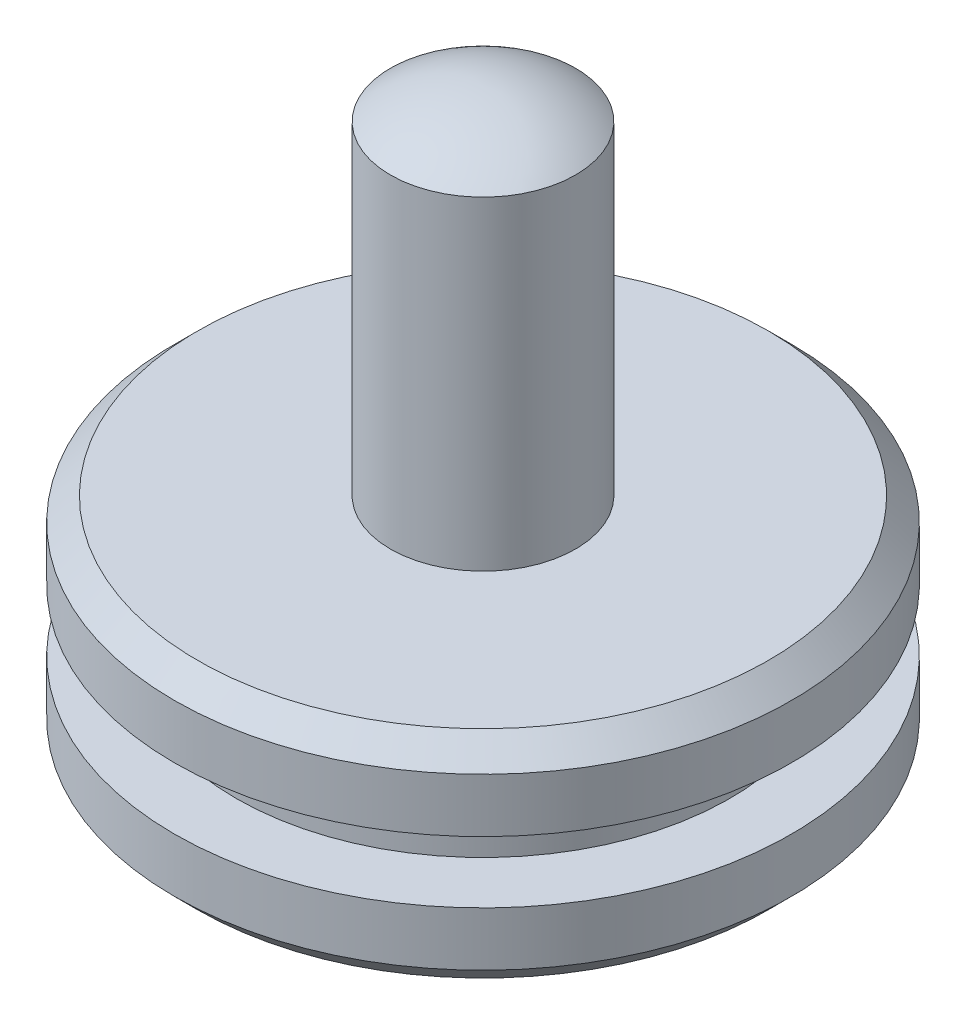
ISO-10303-21;
HEADER;
FILE_DESCRIPTION(('STEP AP214'),'2;1');
FILE_NAME('part.step','',(''),(''),'','','');
FILE_SCHEMA(('AUTOMOTIVE_DESIGN { 1 0 10303 214 1 1 1 1 }'));
ENDSEC;
DATA;
#1=APPLICATION_CONTEXT('core data for automotive mechanical design processes');
#2=APPLICATION_PROTOCOL_DEFINITION('international standard','automotive_design',2000,#1);
#3=PRODUCT_CONTEXT('',#1,'mechanical');
#4=PRODUCT('Part','Part','',(#3));
#5=PRODUCT_RELATED_PRODUCT_CATEGORY('part','',(#4));
#6=PRODUCT_DEFINITION_FORMATION('','',#4);
#7=PRODUCT_DEFINITION_CONTEXT('part definition',#1,'design');
#8=PRODUCT_DEFINITION('design','',#6,#7);
#9=PRODUCT_DEFINITION_SHAPE('','',#8);
#10=(LENGTH_UNIT() NAMED_UNIT(*) SI_UNIT(.MILLI.,.METRE.));
#11=(NAMED_UNIT(*) PLANE_ANGLE_UNIT() SI_UNIT($,.RADIAN.));
#12=(NAMED_UNIT(*) SI_UNIT($,.STERADIAN.) SOLID_ANGLE_UNIT());
#13=UNCERTAINTY_MEASURE_WITH_UNIT(LENGTH_MEASURE(1.E-05),#10,'distance_accuracy_value','');
#14=(GEOMETRIC_REPRESENTATION_CONTEXT(3) GLOBAL_UNCERTAINTY_ASSIGNED_CONTEXT((#13)) GLOBAL_UNIT_ASSIGNED_CONTEXT((#10,
#11,#12)) REPRESENTATION_CONTEXT('',''));
#15=CARTESIAN_POINT('',(0.,0.,0.));
#16=DIRECTION('',(0.,0.,1.));
#17=DIRECTION('',(1.,0.,0.));
#18=AXIS2_PLACEMENT_3D('',#15,#16,#17);
#19=CARTESIAN_POINT('',(0.,27.,0.));
#20=DIRECTION('',(0.,1.,0.));
#21=DIRECTION('',(1.,0.,0.));
#22=AXIS2_PLACEMENT_3D('',#19,#20,#21);
#23=SPHERICAL_SURFACE('',#22,10.);
#24=CARTESIAN_POINT('',(0.,35.,0.));
#25=DIRECTION('',(0.,1.,0.));
#26=DIRECTION('',(0.,0.,1.));
#27=AXIS2_PLACEMENT_3D('',#24,#25,#26);
#28=CIRCLE('',#27,6.);
#29=CARTESIAN_POINT('',(0.,35.,6.));
#30=VERTEX_POINT('',#29);
#31=EDGE_CURVE('E63',#30,#30,#28,.T.);
#32=ORIENTED_EDGE('',*,*,#31,.T.);
#33=EDGE_LOOP('',(#32));
#34=FACE_BOUND('',#33,.T.);
#35=ADVANCED_FACE('F29',(#34),#23,.T.);
#36=CARTESIAN_POINT('',(20.,0.,0.));
#37=DIRECTION('',(0.,1.,0.));
#38=DIRECTION('',(0.,0.,1.));
#39=AXIS2_PLACEMENT_3D('',#36,#37,#38);
#40=PLANE('',#39);
#41=CARTESIAN_POINT('',(0.,0.,0.));
#42=DIRECTION('',(0.,1.,0.));
#43=DIRECTION('',(0.,0.,1.));
#44=AXIS2_PLACEMENT_3D('',#41,#42,#43);
#45=CIRCLE('',#44,18.5);
#46=CARTESIAN_POINT('',(0.,0.,18.5));
#47=VERTEX_POINT('',#46);
#48=EDGE_CURVE('E10',#47,#47,#45,.F.);
#49=ORIENTED_EDGE('',*,*,#48,.T.);
#50=EDGE_LOOP('',(#49));
#51=FACE_BOUND('',#50,.T.);
#52=ADVANCED_FACE('F87',(#51),#40,.F.);
#53=CARTESIAN_POINT('',(0.,41.,0.));
#54=DIRECTION('',(0.,1.,0.));
#55=DIRECTION('',(0.,0.,1.));
#56=AXIS2_PLACEMENT_3D('',#53,#54,#55);
#57=CYLINDRICAL_SURFACE('',#56,20.);
#58=CARTESIAN_POINT('',(0.,1.50000000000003,0.));
#59=DIRECTION('',(0.,1.,0.));
#60=DIRECTION('',(0.,0.,1.));
#61=AXIS2_PLACEMENT_3D('',#58,#59,#60);
#62=CIRCLE('',#61,20.);
#63=CARTESIAN_POINT('',(0.,1.50000000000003,20.));
#64=VERTEX_POINT('',#63);
#65=EDGE_CURVE('E35',#64,#64,#62,.T.);
#66=ORIENTED_EDGE('',*,*,#65,.T.);
#67=EDGE_LOOP('',(#66));
#68=FACE_BOUND('',#67,.T.);
#69=CARTESIAN_POINT('',(0.,5.,0.));
#70=DIRECTION('',(0.,1.,0.));
#71=DIRECTION('',(0.,0.,1.));
#72=AXIS2_PLACEMENT_3D('',#69,#70,#71);
#73=CIRCLE('',#72,20.);
#74=CARTESIAN_POINT('',(0.,5.,20.));
#75=VERTEX_POINT('',#74);
#76=EDGE_CURVE('E48',#75,#75,#73,.T.);
#77=ORIENTED_EDGE('',*,*,#76,.F.);
#78=EDGE_LOOP('',(#77));
#79=FACE_BOUND('',#78,.T.);
#80=ADVANCED_FACE('F91',(#68,#79),#57,.T.);
#81=CARTESIAN_POINT('',(16.,5.,0.));
#82=DIRECTION('',(0.,-1.,0.));
#83=DIRECTION('',(0.,0.,-1.));
#84=AXIS2_PLACEMENT_3D('',#81,#82,#83);
#85=PLANE('',#84);
#86=CARTESIAN_POINT('',(0.,5.,0.));
#87=DIRECTION('',(0.,1.,0.));
#88=DIRECTION('',(0.,0.,1.));
#89=AXIS2_PLACEMENT_3D('',#86,#87,#88);
#90=CIRCLE('',#89,16.);
#91=CARTESIAN_POINT('',(0.,5.,16.));
#92=VERTEX_POINT('',#91);
#93=EDGE_CURVE('E51',#92,#92,#90,.T.);
#94=ORIENTED_EDGE('',*,*,#93,.F.);
#95=EDGE_LOOP('',(#94));
#96=FACE_BOUND('',#95,.T.);
#97=ORIENTED_EDGE('',*,*,#76,.T.);
#98=EDGE_LOOP('',(#97));
#99=FACE_BOUND('',#98,.T.);
#100=ADVANCED_FACE('F95',(#96,#99),#85,.F.);
#101=CARTESIAN_POINT('',(0.,41.,0.));
#102=DIRECTION('',(0.,1.,0.));
#103=DIRECTION('',(0.,0.,1.));
#104=AXIS2_PLACEMENT_3D('',#101,#102,#103);
#105=CYLINDRICAL_SURFACE('',#104,16.);
#106=CARTESIAN_POINT('',(0.,9.,0.));
#107=DIRECTION('',(0.,1.,0.));
#108=DIRECTION('',(0.,0.,1.));
#109=AXIS2_PLACEMENT_3D('',#106,#107,#108);
#110=CIRCLE('',#109,16.);
#111=CARTESIAN_POINT('',(0.,9.,16.));
#112=VERTEX_POINT('',#111);
#113=EDGE_CURVE('E54',#112,#112,#110,.T.);
#114=ORIENTED_EDGE('',*,*,#113,.F.);
#115=EDGE_LOOP('',(#114));
#116=FACE_BOUND('',#115,.T.);
#117=ORIENTED_EDGE('',*,*,#93,.T.);
#118=EDGE_LOOP('',(#117));
#119=FACE_BOUND('',#118,.T.);
#120=ADVANCED_FACE('F100',(#116,#119),#105,.T.);
#121=CARTESIAN_POINT('',(20.,9.,0.));
#122=DIRECTION('',(0.,1.,0.));
#123=DIRECTION('',(0.,0.,1.));
#124=AXIS2_PLACEMENT_3D('',#121,#122,#123);
#125=PLANE('',#124);
#126=CARTESIAN_POINT('',(0.,9.,0.));
#127=DIRECTION('',(0.,1.,0.));
#128=DIRECTION('',(0.,0.,1.));
#129=AXIS2_PLACEMENT_3D('',#126,#127,#128);
#130=CIRCLE('',#129,20.);
#131=CARTESIAN_POINT('',(0.,9.,20.));
#132=VERTEX_POINT('',#131);
#133=EDGE_CURVE('E57',#132,#132,#130,.T.);
#134=ORIENTED_EDGE('',*,*,#133,.F.);
#135=EDGE_LOOP('',(#134));
#136=FACE_BOUND('',#135,.T.);
#137=ORIENTED_EDGE('',*,*,#113,.T.);
#138=EDGE_LOOP('',(#137));
#139=FACE_BOUND('',#138,.T.);
#140=ADVANCED_FACE('F83',(#136,#139),#125,.F.);
#141=CARTESIAN_POINT('',(0.,41.,0.));
#142=DIRECTION('',(0.,1.,0.));
#143=DIRECTION('',(0.,0.,1.));
#144=AXIS2_PLACEMENT_3D('',#141,#142,#143);
#145=CYLINDRICAL_SURFACE('',#144,20.);
#146=CARTESIAN_POINT('',(0.,12.5,0.));
#147=DIRECTION('',(0.,-1.,0.));
#148=DIRECTION('',(0.,0.,-1.));
#149=AXIS2_PLACEMENT_3D('',#146,#147,#148);
#150=CIRCLE('',#149,20.);
#151=CARTESIAN_POINT('',(0.,12.5,-20.));
#152=VERTEX_POINT('',#151);
#153=EDGE_CURVE('E39',#152,#152,#150,.T.);
#154=ORIENTED_EDGE('',*,*,#153,.T.);
#155=EDGE_LOOP('',(#154));
#156=FACE_BOUND('',#155,.T.);
#157=ORIENTED_EDGE('',*,*,#133,.T.);
#158=EDGE_LOOP('',(#157));
#159=FACE_BOUND('',#158,.T.);
#160=ADVANCED_FACE('F77',(#156,#159),#145,.T.);
#161=CARTESIAN_POINT('',(6.,14.,0.));
#162=DIRECTION('',(0.,-1.,0.));
#163=DIRECTION('',(0.,0.,-1.));
#164=AXIS2_PLACEMENT_3D('',#161,#162,#163);
#165=PLANE('',#164);
#166=CARTESIAN_POINT('',(0.,14.,0.));
#167=DIRECTION('',(0.,-1.,0.));
#168=DIRECTION('',(0.,0.,-1.));
#169=AXIS2_PLACEMENT_3D('',#166,#167,#168);
#170=CIRCLE('',#169,18.5);
#171=CARTESIAN_POINT('',(0.,14.,-18.5));
#172=VERTEX_POINT('',#171);
#173=EDGE_CURVE('E43',#172,#172,#170,.F.);
#174=ORIENTED_EDGE('',*,*,#173,.T.);
#175=EDGE_LOOP('',(#174));
#176=FACE_BOUND('',#175,.T.);
#177=CARTESIAN_POINT('',(0.,14.,0.));
#178=DIRECTION('',(0.,1.,0.));
#179=DIRECTION('',(0.,0.,1.));
#180=AXIS2_PLACEMENT_3D('',#177,#178,#179);
#181=CIRCLE('',#180,6.);
#182=CARTESIAN_POINT('',(0.,14.,6.));
#183=VERTEX_POINT('',#182);
#184=EDGE_CURVE('E60',#183,#183,#181,.T.);
#185=ORIENTED_EDGE('',*,*,#184,.F.);
#186=EDGE_LOOP('',(#185));
#187=FACE_BOUND('',#186,.T.);
#188=ADVANCED_FACE('F72',(#176,#187),#165,.F.);
#189=CARTESIAN_POINT('',(0.,41.,0.));
#190=DIRECTION('',(0.,1.,0.));
#191=DIRECTION('',(0.,0.,1.));
#192=AXIS2_PLACEMENT_3D('',#189,#190,#191);
#193=CYLINDRICAL_SURFACE('',#192,6.);
#194=ORIENTED_EDGE('',*,*,#31,.F.);
#195=EDGE_LOOP('',(#194));
#196=FACE_BOUND('',#195,.T.);
#197=ORIENTED_EDGE('',*,*,#184,.T.);
#198=EDGE_LOOP('',(#197));
#199=FACE_BOUND('',#198,.T.);
#200=ADVANCED_FACE('F68',(#196,#199),#193,.T.);
#201=CARTESIAN_POINT('',(0.,14.,0.));
#202=DIRECTION('',(0.,-1.,0.));
#203=DIRECTION('',(0.,0.,-1.));
#204=AXIS2_PLACEMENT_3D('',#201,#202,#203);
#205=CONICAL_SURFACE('',#204,18.5,0.785398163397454);
#206=ORIENTED_EDGE('',*,*,#153,.F.);
#207=EDGE_LOOP('',(#206));
#208=FACE_BOUND('',#207,.T.);
#209=ORIENTED_EDGE('',*,*,#173,.F.);
#210=EDGE_LOOP('',(#209));
#211=FACE_BOUND('',#210,.T.);
#212=ADVANCED_FACE('F71',(#208,#211),#205,.T.);
#213=CARTESIAN_POINT('',(0.,1.50000000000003,0.));
#214=DIRECTION('',(0.,1.,0.));
#215=DIRECTION('',(0.,0.,1.));
#216=AXIS2_PLACEMENT_3D('',#213,#214,#215);
#217=CONICAL_SURFACE('',#216,20.,0.785398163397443);
#218=ORIENTED_EDGE('',*,*,#48,.F.);
#219=EDGE_LOOP('',(#218));
#220=FACE_BOUND('',#219,.T.);
#221=ORIENTED_EDGE('',*,*,#65,.F.);
#222=EDGE_LOOP('',(#221));
#223=FACE_BOUND('',#222,.T.);
#224=ADVANCED_FACE('F143',(#220,#223),#217,.T.);
#225=CLOSED_SHELL('',(#35,#52,#80,#100,#120,#140,#160,#188,#200,#212,#224));
#226=MANIFOLD_SOLID_BREP('B2',#225);
#227=ADVANCED_BREP_SHAPE_REPRESENTATION('',(#18,#226),#14);
#228=SHAPE_DEFINITION_REPRESENTATION(#9,#227);
ENDSEC;
END-ISO-10303-21;
